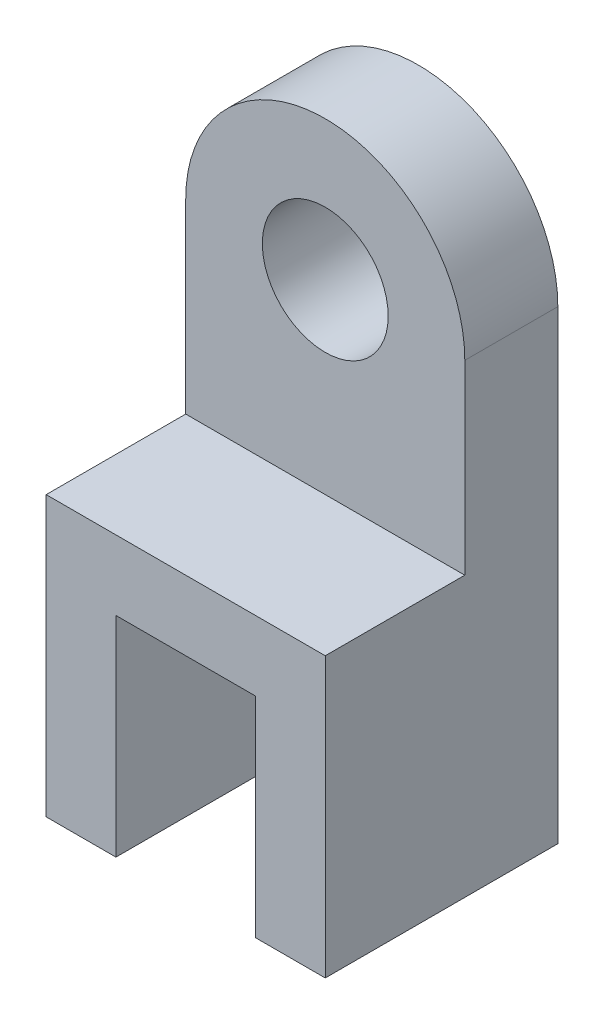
ISO-10303-21;
HEADER;
FILE_DESCRIPTION(('STEP AP214'),'2;1');
FILE_NAME('part.step','',(''),(''),'','','');
FILE_SCHEMA(('AUTOMOTIVE_DESIGN { 1 0 10303 214 1 1 1 1 }'));
ENDSEC;
DATA;
#1=APPLICATION_CONTEXT('core data for automotive mechanical design processes');
#2=APPLICATION_PROTOCOL_DEFINITION('international standard','automotive_design',2000,#1);
#3=PRODUCT_CONTEXT('',#1,'mechanical');
#4=PRODUCT('Part','Part','',(#3));
#5=PRODUCT_RELATED_PRODUCT_CATEGORY('part','',(#4));
#6=PRODUCT_DEFINITION_FORMATION('','',#4);
#7=PRODUCT_DEFINITION_CONTEXT('part definition',#1,'design');
#8=PRODUCT_DEFINITION('design','',#6,#7);
#9=PRODUCT_DEFINITION_SHAPE('','',#8);
#10=(LENGTH_UNIT() NAMED_UNIT(*) SI_UNIT(.MILLI.,.METRE.));
#11=(NAMED_UNIT(*) PLANE_ANGLE_UNIT() SI_UNIT($,.RADIAN.));
#12=(NAMED_UNIT(*) SI_UNIT($,.STERADIAN.) SOLID_ANGLE_UNIT());
#13=UNCERTAINTY_MEASURE_WITH_UNIT(LENGTH_MEASURE(1.E-05),#10,'distance_accuracy_value','');
#14=(GEOMETRIC_REPRESENTATION_CONTEXT(3) GLOBAL_UNCERTAINTY_ASSIGNED_CONTEXT((#13)) GLOBAL_UNIT_ASSIGNED_CONTEXT((#10,
#11,#12)) REPRESENTATION_CONTEXT('',''));
#15=CARTESIAN_POINT('',(0.,0.,0.));
#16=DIRECTION('',(0.,0.,1.));
#17=DIRECTION('',(1.,0.,0.));
#18=AXIS2_PLACEMENT_3D('',#15,#16,#17);
#19=CARTESIAN_POINT('',(-30.,-40.,10.));
#20=DIRECTION('',(1.,0.,0.));
#21=DIRECTION('',(0.,0.,-1.));
#22=AXIS2_PLACEMENT_3D('',#19,#20,#21);
#23=PLANE('',#22);
#24=DIRECTION('',(0.,-1.,0.));
#25=VECTOR('',#24,1.);
#26=CARTESIAN_POINT('',(-30.,-40.,-10.));
#27=LINE('',#26,#25);
#28=CARTESIAN_POINT('',(-30.,0.,-10.));
#29=VERTEX_POINT('',#28);
#30=CARTESIAN_POINT('',(-30.,-100.,-9.99999999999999));
#31=VERTEX_POINT('',#30);
#32=EDGE_CURVE('E129',#29,#31,#27,.T.);
#33=ORIENTED_EDGE('',*,*,#32,.T.);
#34=DIRECTION('',(0.,0.,1.));
#35=VECTOR('',#34,1.);
#36=CARTESIAN_POINT('',(-30.,-100.,-88.1024967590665));
#37=LINE('',#36,#35);
#38=CARTESIAN_POINT('',(-30.,-100.,40.));
#39=VERTEX_POINT('',#38);
#40=EDGE_CURVE('E126',#31,#39,#37,.T.);
#41=ORIENTED_EDGE('',*,*,#40,.T.);
#42=DIRECTION('',(0.,1.,0.));
#43=VECTOR('',#42,1.);
#44=CARTESIAN_POINT('',(-30.,-50.,40.));
#45=LINE('',#44,#43);
#46=CARTESIAN_POINT('',(-30.,-40.,40.));
#47=VERTEX_POINT('',#46);
#48=EDGE_CURVE('E111',#39,#47,#45,.T.);
#49=ORIENTED_EDGE('',*,*,#48,.T.);
#50=DIRECTION('',(0.,0.,-1.));
#51=VECTOR('',#50,1.);
#52=CARTESIAN_POINT('',(-30.,-40.,-10.));
#53=LINE('',#52,#51);
#54=CARTESIAN_POINT('',(-30.,-40.,10.));
#55=VERTEX_POINT('',#54);
#56=EDGE_CURVE('E173',#47,#55,#53,.T.);
#57=ORIENTED_EDGE('',*,*,#56,.T.);
#58=DIRECTION('',(0.,-1.,0.));
#59=VECTOR('',#58,1.);
#60=CARTESIAN_POINT('',(-30.,-40.,10.));
#61=LINE('',#60,#59);
#62=CARTESIAN_POINT('',(-30.,0.,10.));
#63=VERTEX_POINT('',#62);
#64=EDGE_CURVE('E183',#63,#55,#61,.T.);
#65=ORIENTED_EDGE('',*,*,#64,.F.);
#66=DIRECTION('',(0.,0.,-1.));
#67=VECTOR('',#66,1.);
#68=CARTESIAN_POINT('',(-30.,0.,10.));
#69=LINE('',#68,#67);
#70=EDGE_CURVE('E40',#63,#29,#69,.T.);
#71=ORIENTED_EDGE('',*,*,#70,.T.);
#72=EDGE_LOOP('',(#33,#41,#49,#57,#65,#71));
#73=FACE_BOUND('',#72,.T.);
#74=ADVANCED_FACE('F32',(#73),#23,.F.);
#75=CARTESIAN_POINT('',(30.,-40.,10.));
#76=DIRECTION('',(-1.,0.,0.));
#77=DIRECTION('',(0.,0.,1.));
#78=AXIS2_PLACEMENT_3D('',#75,#76,#77);
#79=PLANE('',#78);
#80=DIRECTION('',(0.,1.,0.));
#81=VECTOR('',#80,1.);
#82=CARTESIAN_POINT('',(30.,-40.,-10.));
#83=LINE('',#82,#81);
#84=CARTESIAN_POINT('',(30.,-100.,-9.99999999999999));
#85=VERTEX_POINT('',#84);
#86=CARTESIAN_POINT('',(30.,0.,-10.));
#87=VERTEX_POINT('',#86);
#88=EDGE_CURVE('E179',#85,#87,#83,.T.);
#89=ORIENTED_EDGE('',*,*,#88,.T.);
#90=DIRECTION('',(0.,0.,-1.));
#91=VECTOR('',#90,1.);
#92=CARTESIAN_POINT('',(30.,0.,10.));
#93=LINE('',#92,#91);
#94=CARTESIAN_POINT('',(30.,0.,10.));
#95=VERTEX_POINT('',#94);
#96=EDGE_CURVE('E11',#95,#87,#93,.T.);
#97=ORIENTED_EDGE('',*,*,#96,.F.);
#98=DIRECTION('',(0.,1.,0.));
#99=VECTOR('',#98,1.);
#100=CARTESIAN_POINT('',(30.,-40.,10.));
#101=LINE('',#100,#99);
#102=CARTESIAN_POINT('',(30.,-40.,10.));
#103=VERTEX_POINT('',#102);
#104=EDGE_CURVE('E53',#103,#95,#101,.T.);
#105=ORIENTED_EDGE('',*,*,#104,.F.);
#106=DIRECTION('',(0.,0.,1.));
#107=VECTOR('',#106,1.);
#108=CARTESIAN_POINT('',(30.,-40.,-10.));
#109=LINE('',#108,#107);
#110=CARTESIAN_POINT('',(30.,-40.,40.));
#111=VERTEX_POINT('',#110);
#112=EDGE_CURVE('E176',#103,#111,#109,.T.);
#113=ORIENTED_EDGE('',*,*,#112,.T.);
#114=DIRECTION('',(0.,1.,0.));
#115=VECTOR('',#114,1.);
#116=CARTESIAN_POINT('',(30.,-50.,40.));
#117=LINE('',#116,#115);
#118=CARTESIAN_POINT('',(30.,-100.,40.));
#119=VERTEX_POINT('',#118);
#120=EDGE_CURVE('E123',#119,#111,#117,.T.);
#121=ORIENTED_EDGE('',*,*,#120,.F.);
#122=DIRECTION('',(0.,0.,1.));
#123=VECTOR('',#122,1.);
#124=CARTESIAN_POINT('',(30.,-100.,-88.1024967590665));
#125=LINE('',#124,#123);
#126=EDGE_CURVE('E154',#85,#119,#125,.T.);
#127=ORIENTED_EDGE('',*,*,#126,.F.);
#128=EDGE_LOOP('',(#89,#97,#105,#113,#121,#127));
#129=FACE_BOUND('',#128,.T.);
#130=ADVANCED_FACE('F199',(#129),#79,.F.);
#131=CARTESIAN_POINT('',(0.,0.,10.));
#132=DIRECTION('',(0.,0.,-1.));
#133=DIRECTION('',(-1.,0.,0.));
#134=AXIS2_PLACEMENT_3D('',#131,#132,#133);
#135=CYLINDRICAL_SURFACE('',#134,30.);
#136=CARTESIAN_POINT('',(0.,0.,-10.));
#137=DIRECTION('',(0.,0.,1.));
#138=DIRECTION('',(1.,0.,0.));
#139=AXIS2_PLACEMENT_3D('',#136,#137,#138);
#140=CIRCLE('',#139,30.);
#141=EDGE_CURVE('E181',#87,#29,#140,.T.);
#142=ORIENTED_EDGE('',*,*,#141,.T.);
#143=ORIENTED_EDGE('',*,*,#70,.F.);
#144=CARTESIAN_POINT('',(0.,0.,10.));
#145=DIRECTION('',(0.,0.,1.));
#146=DIRECTION('',(1.,0.,0.));
#147=AXIS2_PLACEMENT_3D('',#144,#145,#146);
#148=CIRCLE('',#147,30.);
#149=EDGE_CURVE('E48',#95,#63,#148,.T.);
#150=ORIENTED_EDGE('',*,*,#149,.F.);
#151=ORIENTED_EDGE('',*,*,#96,.T.);
#152=EDGE_LOOP('',(#142,#143,#150,#151));
#153=FACE_BOUND('',#152,.T.);
#154=ADVANCED_FACE('F210',(#153),#135,.T.);
#155=CARTESIAN_POINT('',(0.,0.,10.));
#156=DIRECTION('',(0.,0.,1.));
#157=DIRECTION('',(1.,0.,0.));
#158=AXIS2_PLACEMENT_3D('',#155,#156,#157);
#159=PLANE('',#158);
#160=CARTESIAN_POINT('',(0.,0.,10.));
#161=DIRECTION('',(0.,0.,1.));
#162=DIRECTION('',(1.,0.,0.));
#163=AXIS2_PLACEMENT_3D('',#160,#161,#162);
#164=CIRCLE('',#163,13.5287305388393);
#165=CARTESIAN_POINT('',(13.5287305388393,0.,10.));
#166=VERTEX_POINT('',#165);
#167=EDGE_CURVE('E165',#166,#166,#164,.T.);
#168=ORIENTED_EDGE('',*,*,#167,.F.);
#169=EDGE_LOOP('',(#168));
#170=FACE_BOUND('',#169,.T.);
#171=ORIENTED_EDGE('',*,*,#64,.T.);
#172=DIRECTION('',(1.,0.,0.));
#173=VECTOR('',#172,1.);
#174=CARTESIAN_POINT('',(-30.,-40.,10.));
#175=LINE('',#174,#173);
#176=EDGE_CURVE('E188',#55,#103,#175,.T.);
#177=ORIENTED_EDGE('',*,*,#176,.T.);
#178=ORIENTED_EDGE('',*,*,#104,.T.);
#179=ORIENTED_EDGE('',*,*,#149,.T.);
#180=EDGE_LOOP('',(#171,#177,#178,#179));
#181=FACE_BOUND('',#180,.T.);
#182=ADVANCED_FACE('F195',(#170,#181),#159,.T.);
#183=CARTESIAN_POINT('',(0.,0.,-10.));
#184=DIRECTION('',(0.,0.,1.));
#185=DIRECTION('',(1.,0.,0.));
#186=AXIS2_PLACEMENT_3D('',#183,#184,#185);
#187=PLANE('',#186);
#188=CARTESIAN_POINT('',(0.,0.,-9.99999999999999));
#189=DIRECTION('',(0.,0.,1.));
#190=DIRECTION('',(1.,0.,0.));
#191=AXIS2_PLACEMENT_3D('',#188,#189,#190);
#192=CIRCLE('',#191,13.5287305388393);
#193=CARTESIAN_POINT('',(13.5287305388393,0.,-9.99999999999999));
#194=VERTEX_POINT('',#193);
#195=EDGE_CURVE('E35',#194,#194,#192,.T.);
#196=ORIENTED_EDGE('',*,*,#195,.T.);
#197=EDGE_LOOP('',(#196));
#198=FACE_BOUND('',#197,.T.);
#199=ORIENTED_EDGE('',*,*,#32,.F.);
#200=ORIENTED_EDGE('',*,*,#141,.F.);
#201=ORIENTED_EDGE('',*,*,#88,.F.);
#202=DIRECTION('',(-1.,0.,0.));
#203=VECTOR('',#202,1.);
#204=CARTESIAN_POINT('',(15.,-100.,-9.99999999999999));
#205=LINE('',#204,#203);
#206=CARTESIAN_POINT('',(15.,-100.,-9.99999999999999));
#207=VERTEX_POINT('',#206);
#208=EDGE_CURVE('E144',#85,#207,#205,.T.);
#209=ORIENTED_EDGE('',*,*,#208,.T.);
#210=DIRECTION('',(0.,1.,0.));
#211=VECTOR('',#210,1.);
#212=CARTESIAN_POINT('',(15.,-55.,-9.99999999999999));
#213=LINE('',#212,#211);
#214=CARTESIAN_POINT('',(15.,-55.,-9.99999999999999));
#215=VERTEX_POINT('',#214);
#216=EDGE_CURVE('E218',#207,#215,#213,.T.);
#217=ORIENTED_EDGE('',*,*,#216,.T.);
#218=DIRECTION('',(-1.,0.,0.));
#219=VECTOR('',#218,1.);
#220=CARTESIAN_POINT('',(-15.,-55.,-9.99999999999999));
#221=LINE('',#220,#219);
#222=CARTESIAN_POINT('',(-15.,-55.,-9.99999999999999));
#223=VERTEX_POINT('',#222);
#224=EDGE_CURVE('E215',#215,#223,#221,.T.);
#225=ORIENTED_EDGE('',*,*,#224,.T.);
#226=DIRECTION('',(0.,-1.,0.));
#227=VECTOR('',#226,1.);
#228=CARTESIAN_POINT('',(-15.,-100.,-9.99999999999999));
#229=LINE('',#228,#227);
#230=CARTESIAN_POINT('',(-15.,-100.,-9.99999999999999));
#231=VERTEX_POINT('',#230);
#232=EDGE_CURVE('E213',#223,#231,#229,.T.);
#233=ORIENTED_EDGE('',*,*,#232,.T.);
#234=DIRECTION('',(-1.,0.,0.));
#235=VECTOR('',#234,1.);
#236=CARTESIAN_POINT('',(-30.,-100.,-9.99999999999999));
#237=LINE('',#236,#235);
#238=EDGE_CURVE('E157',#231,#31,#237,.T.);
#239=ORIENTED_EDGE('',*,*,#238,.T.);
#240=EDGE_LOOP('',(#199,#200,#201,#209,#217,#225,#233,#239));
#241=FACE_BOUND('',#240,.T.);
#242=ADVANCED_FACE('F211',(#198,#241),#187,.F.);
#243=CARTESIAN_POINT('',(-30.,-40.,40.));
#244=DIRECTION('',(0.,1.,0.));
#245=DIRECTION('',(0.,0.,1.));
#246=AXIS2_PLACEMENT_3D('',#243,#244,#245);
#247=PLANE('',#246);
#248=ORIENTED_EDGE('',*,*,#176,.F.);
#249=ORIENTED_EDGE('',*,*,#56,.F.);
#250=DIRECTION('',(-1.,0.,0.));
#251=VECTOR('',#250,1.);
#252=CARTESIAN_POINT('',(-30.,-40.,40.));
#253=LINE('',#252,#251);
#254=EDGE_CURVE('E119',#111,#47,#253,.T.);
#255=ORIENTED_EDGE('',*,*,#254,.F.);
#256=ORIENTED_EDGE('',*,*,#112,.F.);
#257=EDGE_LOOP('',(#248,#249,#255,#256));
#258=FACE_BOUND('',#257,.T.);
#259=ADVANCED_FACE('F197',(#258),#247,.T.);
#260=CARTESIAN_POINT('',(-30.,-50.,40.));
#261=DIRECTION('',(0.,0.,-1.));
#262=DIRECTION('',(-1.,0.,0.));
#263=AXIS2_PLACEMENT_3D('',#260,#261,#262);
#264=PLANE('',#263);
#265=ORIENTED_EDGE('',*,*,#254,.T.);
#266=ORIENTED_EDGE('',*,*,#48,.F.);
#267=DIRECTION('',(1.,0.,0.));
#268=VECTOR('',#267,1.);
#269=CARTESIAN_POINT('',(-30.,-100.,40.));
#270=LINE('',#269,#268);
#271=CARTESIAN_POINT('',(-15.,-100.,40.));
#272=VERTEX_POINT('',#271);
#273=EDGE_CURVE('E116',#39,#272,#270,.T.);
#274=ORIENTED_EDGE('',*,*,#273,.T.);
#275=DIRECTION('',(0.,1.,0.));
#276=VECTOR('',#275,1.);
#277=CARTESIAN_POINT('',(-15.,-100.,40.));
#278=LINE('',#277,#276);
#279=CARTESIAN_POINT('',(-15.,-55.,40.));
#280=VERTEX_POINT('',#279);
#281=EDGE_CURVE('E139',#272,#280,#278,.T.);
#282=ORIENTED_EDGE('',*,*,#281,.T.);
#283=DIRECTION('',(1.,0.,0.));
#284=VECTOR('',#283,1.);
#285=CARTESIAN_POINT('',(-15.,-55.,40.));
#286=LINE('',#285,#284);
#287=CARTESIAN_POINT('',(15.,-55.,40.));
#288=VERTEX_POINT('',#287);
#289=EDGE_CURVE('E141',#280,#288,#286,.T.);
#290=ORIENTED_EDGE('',*,*,#289,.T.);
#291=DIRECTION('',(0.,-1.,0.));
#292=VECTOR('',#291,1.);
#293=CARTESIAN_POINT('',(15.,-55.,40.));
#294=LINE('',#293,#292);
#295=CARTESIAN_POINT('',(15.,-100.,40.));
#296=VERTEX_POINT('',#295);
#297=EDGE_CURVE('E149',#288,#296,#294,.T.);
#298=ORIENTED_EDGE('',*,*,#297,.T.);
#299=DIRECTION('',(1.,0.,0.));
#300=VECTOR('',#299,1.);
#301=CARTESIAN_POINT('',(15.,-100.,40.));
#302=LINE('',#301,#300);
#303=EDGE_CURVE('E134',#296,#119,#302,.T.);
#304=ORIENTED_EDGE('',*,*,#303,.T.);
#305=ORIENTED_EDGE('',*,*,#120,.T.);
#306=EDGE_LOOP('',(#265,#266,#274,#282,#290,#298,#304,#305));
#307=FACE_BOUND('',#306,.T.);
#308=ADVANCED_FACE('F113',(#307),#264,.F.);
#309=CARTESIAN_POINT('',(0.,0.,-51.));
#310=DIRECTION('',(0.,0.,1.));
#311=DIRECTION('',(1.,0.,0.));
#312=AXIS2_PLACEMENT_3D('',#309,#310,#311);
#313=CYLINDRICAL_SURFACE('',#312,13.5287305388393);
#314=ORIENTED_EDGE('',*,*,#167,.T.);
#315=EDGE_LOOP('',(#314));
#316=FACE_BOUND('',#315,.T.);
#317=ORIENTED_EDGE('',*,*,#195,.F.);
#318=EDGE_LOOP('',(#317));
#319=FACE_BOUND('',#318,.T.);
#320=ADVANCED_FACE('F255',(#316,#319),#313,.F.);
#321=CARTESIAN_POINT('',(15.,-100.,-88.1024967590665));
#322=DIRECTION('',(0.,-1.,0.));
#323=DIRECTION('',(0.,0.,-1.));
#324=AXIS2_PLACEMENT_3D('',#321,#322,#323);
#325=PLANE('',#324);
#326=ORIENTED_EDGE('',*,*,#208,.F.);
#327=ORIENTED_EDGE('',*,*,#126,.T.);
#328=ORIENTED_EDGE('',*,*,#303,.F.);
#329=DIRECTION('',(0.,0.,1.));
#330=VECTOR('',#329,1.);
#331=CARTESIAN_POINT('',(15.,-100.,-88.1024967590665));
#332=LINE('',#331,#330);
#333=EDGE_CURVE('E158',#207,#296,#332,.T.);
#334=ORIENTED_EDGE('',*,*,#333,.F.);
#335=EDGE_LOOP('',(#326,#327,#328,#334));
#336=FACE_BOUND('',#335,.T.);
#337=ADVANCED_FACE('F206',(#336),#325,.T.);
#338=CARTESIAN_POINT('',(15.,-55.,-88.1024967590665));
#339=DIRECTION('',(-1.,0.,0.));
#340=DIRECTION('',(0.,-1.,0.));
#341=AXIS2_PLACEMENT_3D('',#338,#339,#340);
#342=PLANE('',#341);
#343=ORIENTED_EDGE('',*,*,#216,.F.);
#344=ORIENTED_EDGE('',*,*,#333,.T.);
#345=ORIENTED_EDGE('',*,*,#297,.F.);
#346=DIRECTION('',(0.,0.,1.));
#347=VECTOR('',#346,1.);
#348=CARTESIAN_POINT('',(15.,-55.,-88.1024967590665));
#349=LINE('',#348,#347);
#350=EDGE_CURVE('E160',#215,#288,#349,.T.);
#351=ORIENTED_EDGE('',*,*,#350,.F.);
#352=EDGE_LOOP('',(#343,#344,#345,#351));
#353=FACE_BOUND('',#352,.T.);
#354=ADVANCED_FACE('F223',(#353),#342,.T.);
#355=CARTESIAN_POINT('',(-15.,-55.,-88.1024967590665));
#356=DIRECTION('',(0.,-1.,0.));
#357=DIRECTION('',(0.,0.,-1.));
#358=AXIS2_PLACEMENT_3D('',#355,#356,#357);
#359=PLANE('',#358);
#360=ORIENTED_EDGE('',*,*,#224,.F.);
#361=ORIENTED_EDGE('',*,*,#350,.T.);
#362=ORIENTED_EDGE('',*,*,#289,.F.);
#363=DIRECTION('',(0.,0.,1.));
#364=VECTOR('',#363,1.);
#365=CARTESIAN_POINT('',(-15.,-55.,-88.1024967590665));
#366=LINE('',#365,#364);
#367=EDGE_CURVE('E162',#223,#280,#366,.T.);
#368=ORIENTED_EDGE('',*,*,#367,.F.);
#369=EDGE_LOOP('',(#360,#361,#362,#368));
#370=FACE_BOUND('',#369,.T.);
#371=ADVANCED_FACE('F226',(#370),#359,.T.);
#372=CARTESIAN_POINT('',(-15.,-100.,-88.1024967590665));
#373=DIRECTION('',(1.,0.,0.));
#374=DIRECTION('',(0.,0.,-1.));
#375=AXIS2_PLACEMENT_3D('',#372,#373,#374);
#376=PLANE('',#375);
#377=ORIENTED_EDGE('',*,*,#232,.F.);
#378=ORIENTED_EDGE('',*,*,#367,.T.);
#379=ORIENTED_EDGE('',*,*,#281,.F.);
#380=DIRECTION('',(0.,0.,1.));
#381=VECTOR('',#380,1.);
#382=CARTESIAN_POINT('',(-15.,-100.,-88.1024967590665));
#383=LINE('',#382,#381);
#384=EDGE_CURVE('E133',#231,#272,#383,.T.);
#385=ORIENTED_EDGE('',*,*,#384,.F.);
#386=EDGE_LOOP('',(#377,#378,#379,#385));
#387=FACE_BOUND('',#386,.T.);
#388=ADVANCED_FACE('F229',(#387),#376,.T.);
#389=CARTESIAN_POINT('',(-30.,-100.,-88.1024967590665));
#390=DIRECTION('',(0.,-1.,0.));
#391=DIRECTION('',(0.,0.,-1.));
#392=AXIS2_PLACEMENT_3D('',#389,#390,#391);
#393=PLANE('',#392);
#394=ORIENTED_EDGE('',*,*,#238,.F.);
#395=ORIENTED_EDGE('',*,*,#384,.T.);
#396=ORIENTED_EDGE('',*,*,#273,.F.);
#397=ORIENTED_EDGE('',*,*,#40,.F.);
#398=EDGE_LOOP('',(#394,#395,#396,#397));
#399=FACE_BOUND('',#398,.T.);
#400=ADVANCED_FACE('F136',(#399),#393,.T.);
#401=CLOSED_SHELL('',(#74,#130,#154,#182,#242,#259,#308,#320,#337,#354,#371,#388,#400));
#402=MANIFOLD_SOLID_BREP('B2',#401);
#403=ADVANCED_BREP_SHAPE_REPRESENTATION('',(#18,#402),#14);
#404=SHAPE_DEFINITION_REPRESENTATION(#9,#403);
ENDSEC;
END-ISO-10303-21;
